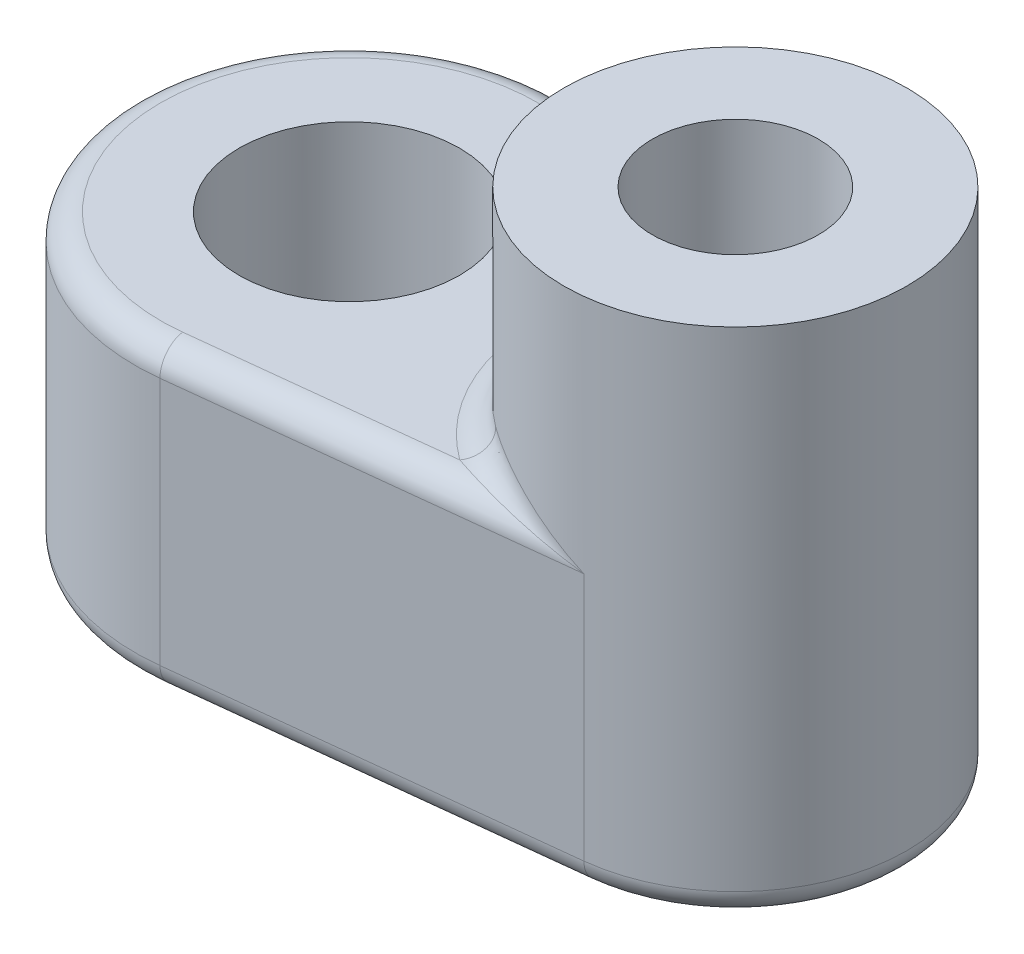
ISO-10303-21;
HEADER;
FILE_DESCRIPTION(('STEP AP214'),'2;1');
FILE_NAME('part.step','',(''),(''),'','','');
FILE_SCHEMA(('AUTOMOTIVE_DESIGN { 1 0 10303 214 1 1 1 1 }'));
ENDSEC;
DATA;
#1=APPLICATION_CONTEXT('core data for automotive mechanical design processes');
#2=APPLICATION_PROTOCOL_DEFINITION('international standard','automotive_design',2000,#1);
#3=PRODUCT_CONTEXT('',#1,'mechanical');
#4=PRODUCT('Part','Part','',(#3));
#5=PRODUCT_RELATED_PRODUCT_CATEGORY('part','',(#4));
#6=PRODUCT_DEFINITION_FORMATION('','',#4);
#7=PRODUCT_DEFINITION_CONTEXT('part definition',#1,'design');
#8=PRODUCT_DEFINITION('design','',#6,#7);
#9=PRODUCT_DEFINITION_SHAPE('','',#8);
#10=(LENGTH_UNIT() NAMED_UNIT(*) SI_UNIT(.MILLI.,.METRE.));
#11=(NAMED_UNIT(*) PLANE_ANGLE_UNIT() SI_UNIT($,.RADIAN.));
#12=(NAMED_UNIT(*) SI_UNIT($,.STERADIAN.) SOLID_ANGLE_UNIT());
#13=UNCERTAINTY_MEASURE_WITH_UNIT(LENGTH_MEASURE(1.E-05),#10,'distance_accuracy_value','');
#14=(GEOMETRIC_REPRESENTATION_CONTEXT(3) GLOBAL_UNCERTAINTY_ASSIGNED_CONTEXT((#13)) GLOBAL_UNIT_ASSIGNED_CONTEXT((#10,
#11,#12)) REPRESENTATION_CONTEXT('',''));
#15=CARTESIAN_POINT('',(0.,0.,0.));
#16=DIRECTION('',(0.,0.,1.));
#17=DIRECTION('',(1.,0.,0.));
#18=AXIS2_PLACEMENT_3D('',#15,#16,#17);
#19=CARTESIAN_POINT('',(-11.43,8.89,0.));
#20=DIRECTION('',(0.,-1.,0.));
#21=DIRECTION('',(0.,0.,-1.));
#22=AXIS2_PLACEMENT_3D('',#19,#20,#21);
#23=CYLINDRICAL_SURFACE('',#22,6.35);
#24=DIRECTION('',(0.,-1.,0.));
#25=VECTOR('',#24,1.);
#26=CARTESIAN_POINT('',(-10.7244444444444,8.89,-6.31068073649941));
#27=LINE('',#26,#25);
#28=CARTESIAN_POINT('',(-10.7244444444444,8.128,-6.31068073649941));
#29=VERTEX_POINT('',#28);
#30=CARTESIAN_POINT('',(-10.7244444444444,0.762000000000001,-6.31068073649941));
#31=VERTEX_POINT('',#30);
#32=EDGE_CURVE('E170',#29,#31,#27,.T.);
#33=ORIENTED_EDGE('',*,*,#32,.T.);
#34=CARTESIAN_POINT('',(-11.43,0.762000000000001,0.));
#35=DIRECTION('',(0.,1.,0.));
#36=DIRECTION('',(0.,0.,1.));
#37=AXIS2_PLACEMENT_3D('',#34,#35,#36);
#38=CIRCLE('',#37,6.35);
#39=CARTESIAN_POINT('',(-10.7244444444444,0.762000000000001,6.31068073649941));
#40=VERTEX_POINT('',#39);
#41=EDGE_CURVE('E139',#31,#40,#38,.T.);
#42=ORIENTED_EDGE('',*,*,#41,.T.);
#43=DIRECTION('',(0.,-1.,0.));
#44=VECTOR('',#43,1.);
#45=CARTESIAN_POINT('',(-10.7244444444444,8.89,6.31068073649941));
#46=LINE('',#45,#44);
#47=CARTESIAN_POINT('',(-10.7244444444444,8.128,6.31068073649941));
#48=VERTEX_POINT('',#47);
#49=EDGE_CURVE('E122',#48,#40,#46,.T.);
#50=ORIENTED_EDGE('',*,*,#49,.F.);
#51=CARTESIAN_POINT('',(-11.43,8.128,0.));
#52=DIRECTION('',(0.,1.,0.));
#53=DIRECTION('',(0.,0.,1.));
#54=AXIS2_PLACEMENT_3D('',#51,#52,#53);
#55=CIRCLE('',#54,6.35);
#56=EDGE_CURVE('E136',#48,#29,#55,.F.);
#57=ORIENTED_EDGE('',*,*,#56,.T.);
#58=EDGE_LOOP('',(#33,#42,#50,#57));
#59=FACE_BOUND('',#58,.T.);
#60=ADVANCED_FACE('F43',(#59),#23,.T.);
#61=CARTESIAN_POINT('',(-10.7244444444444,8.89,6.31068073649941));
#62=DIRECTION('',(-0.111111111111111,0.,-0.993807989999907));
#63=DIRECTION('',(-0.993807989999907,0.,0.111111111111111));
#64=AXIS2_PLACEMENT_3D('',#61,#62,#63);
#65=PLANE('',#64);
#66=ORIENTED_EDGE('',*,*,#49,.T.);
#67=DIRECTION('',(0.993807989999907,0.,-0.111111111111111));
#68=VECTOR('',#67,1.);
#69=CARTESIAN_POINT('',(-10.7244444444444,0.762000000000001,6.31068073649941));
#70=LINE('',#69,#68);
#71=CARTESIAN_POINT('',(0.564444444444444,0.762000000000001,5.04854458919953));
#72=VERTEX_POINT('',#71);
#73=EDGE_CURVE('E129',#40,#72,#70,.T.);
#74=ORIENTED_EDGE('',*,*,#73,.T.);
#75=DIRECTION('',(0.,-1.,0.));
#76=VECTOR('',#75,1.);
#77=CARTESIAN_POINT('',(0.564444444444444,8.89,5.04854458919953));
#78=LINE('',#77,#76);
#79=CARTESIAN_POINT('',(0.564444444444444,8.128,5.04854458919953));
#80=VERTEX_POINT('',#79);
#81=EDGE_CURVE('E124',#80,#72,#78,.T.);
#82=ORIENTED_EDGE('',*,*,#81,.F.);
#83=DIRECTION('',(0.993807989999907,0.,-0.111111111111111));
#84=VECTOR('',#83,1.);
#85=CARTESIAN_POINT('',(-10.7244444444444,8.128,6.31068073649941));
#86=LINE('',#85,#84);
#87=EDGE_CURVE('E119',#80,#48,#86,.F.);
#88=ORIENTED_EDGE('',*,*,#87,.T.);
#89=EDGE_LOOP('',(#66,#74,#82,#88));
#90=FACE_BOUND('',#89,.T.);
#91=ADVANCED_FACE('F121',(#90),#65,.F.);
#92=CARTESIAN_POINT('',(0.,8.89,0.));
#93=DIRECTION('',(0.,-1.,0.));
#94=DIRECTION('',(0.,0.,-1.));
#95=AXIS2_PLACEMENT_3D('',#92,#93,#94);
#96=CYLINDRICAL_SURFACE('',#95,5.08);
#97=ORIENTED_EDGE('',*,*,#81,.T.);
#98=CARTESIAN_POINT('',(0.,0.762000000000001,0.));
#99=DIRECTION('',(0.,1.,0.));
#100=DIRECTION('',(0.,0.,1.));
#101=AXIS2_PLACEMENT_3D('',#98,#99,#100);
#102=CIRCLE('',#101,5.08);
#103=CARTESIAN_POINT('',(0.564444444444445,0.762000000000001,-5.04854458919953));
#104=VERTEX_POINT('',#103);
#105=EDGE_CURVE('E181',#72,#104,#102,.T.);
#106=ORIENTED_EDGE('',*,*,#105,.T.);
#107=DIRECTION('',(0.,-1.,0.));
#108=VECTOR('',#107,1.);
#109=CARTESIAN_POINT('',(0.564444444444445,8.89,-5.04854458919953));
#110=LINE('',#109,#108);
#111=CARTESIAN_POINT('',(0.564444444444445,8.128,-5.04854458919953));
#112=VERTEX_POINT('',#111);
#113=EDGE_CURVE('E167',#112,#104,#110,.T.);
#114=ORIENTED_EDGE('',*,*,#113,.F.);
#115=CARTESIAN_POINT('',(-3.98769296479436,8.838619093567,-4.51395563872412));
#116=CARTESIAN_POINT('',(-3.29523797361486,8.62296157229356,-3.87593706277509));
#117=CARTESIAN_POINT('',(-3.49413608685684,9.549238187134,-3.68746701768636));
#118=CARTESIAN_POINT('',(-3.94517550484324,8.84782040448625,-4.53312874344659));
#119=CARTESIAN_POINT('',(-3.27762508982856,8.64982975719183,-3.88864594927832));
#120=CARTESIAN_POINT('',(-3.45486693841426,9.56764080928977,-3.72468824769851));
#121=CARTESIAN_POINT('',(-3.90141010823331,8.85564149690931,-4.55212354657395));
#122=CARTESIAN_POINT('',(-3.25763028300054,8.67632227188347,-3.90375735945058));
#123=CARTESIAN_POINT('',(-3.41451635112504,9.58328299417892,-3.76172112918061));
#124=CARTESIAN_POINT('',(-3.81176014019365,8.86873870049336,-4.58953542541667));
#125=CARTESIAN_POINT('',(-3.21327983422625,8.72697636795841,-3.93778229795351));
#126=CARTESIAN_POINT('',(-3.33200513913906,9.60947740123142,-3.83499183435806));
#127=CARTESIAN_POINT('',(-3.76587915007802,8.87401895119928,-4.60795339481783));
#128=CARTESIAN_POINT('',(-3.18904565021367,8.75117214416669,-3.95659184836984));
#129=CARTESIAN_POINT('',(-3.28984758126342,9.62003790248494,-3.87123085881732));
#130=CARTESIAN_POINT('',(-3.62631706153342,8.88632839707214,-4.66175561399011));
#131=CARTESIAN_POINT('',(-3.1113794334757,8.81805531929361,-4.01650319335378));
#132=CARTESIAN_POINT('',(-3.16182489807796,9.64465679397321,-3.97762311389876));
#133=CARTESIAN_POINT('',(-3.52988329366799,8.88999482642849,-4.69606578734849));
#134=CARTESIAN_POINT('',(-3.05151896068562,8.85739330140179,-4.06225554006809));
#135=CARTESIAN_POINT('',(-3.07363972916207,9.65198965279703,-4.04618422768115));
#136=CARTESIAN_POINT('',(-3.28429874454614,8.8900076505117,-4.77641232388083));
#137=CARTESIAN_POINT('',(-2.88753085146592,8.93578793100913,-4.18118395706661));
#138=CARTESIAN_POINT('',(-2.8497366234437,9.65201530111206,-4.20863583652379));
#139=CARTESIAN_POINT('',(-3.13201317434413,8.88200903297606,-4.82019827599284));
#140=CARTESIAN_POINT('',(-2.77486322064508,8.96849334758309,-4.25827629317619));
#141=CARTESIAN_POINT('',(-2.71147521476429,9.63601806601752,-4.29893773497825));
#142=CARTESIAN_POINT('',(-2.81961818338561,8.85449779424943,-4.89876490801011));
#143=CARTESIAN_POINT('',(-2.52900124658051,9.00345707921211,-4.40932739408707));
#144=CARTESIAN_POINT('',(-2.42892974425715,9.58099558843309,-4.46472811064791));
#145=CARTESIAN_POINT('',(-2.65946824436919,8.83491816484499,-4.933491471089));
#146=CARTESIAN_POINT('',(-2.3960602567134,9.00720488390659,-4.48385035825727));
#147=CARTESIAN_POINT('',(-2.28461521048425,9.54183632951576,-4.54012694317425));
#148=CARTESIAN_POINT('',(-2.37257788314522,8.79302674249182,-4.98675289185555));
#149=CARTESIAN_POINT('',(-2.14937275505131,8.99258864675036,-4.60626047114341));
#150=CARTESIAN_POINT('',(-2.02695128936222,9.45805348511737,-4.65973095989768));
#151=CARTESIAN_POINT('',(-2.24672128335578,8.77240697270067,-5.00717512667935));
#152=CARTESIAN_POINT('',(-2.03913010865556,8.97973066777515,-4.65630858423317));
#153=CARTESIAN_POINT('',(-1.91419870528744,9.41681394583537,-4.70711341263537));
#154=CARTESIAN_POINT('',(-1.99319148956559,8.72739593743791,-5.0427978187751));
#155=CARTESIAN_POINT('',(-1.81398250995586,8.94298299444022,-4.74845264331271));
#156=CARTESIAN_POINT('',(-1.68759578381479,9.32679187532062,-4.79302745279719));
#157=CARTESIAN_POINT('',(-1.86551763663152,8.70300327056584,-5.05799632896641));
#158=CARTESIAN_POINT('',(-1.69877073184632,8.91932611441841,-4.7909457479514));
#159=CARTESIAN_POINT('',(-1.5737450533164,9.27800654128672,-4.83155573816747));
#160=CARTESIAN_POINT('',(-1.48068217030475,8.6255108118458,-5.09604592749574));
#161=CARTESIAN_POINT('',(-1.35275670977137,8.8363972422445,-4.90384090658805));
#162=CARTESIAN_POINT('',(-1.23132063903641,9.12302162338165,-4.93427241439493));
#163=CARTESIAN_POINT('',(-1.22160366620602,8.5680801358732,-5.11136969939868));
#164=CARTESIAN_POINT('',(-1.11105665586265,8.76369080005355,-4.96438587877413));
#165=CARTESIAN_POINT('',(-1.00178228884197,9.00816027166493,-4.98563468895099));
#166=CARTESIAN_POINT('',(-0.709926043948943,8.44868944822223,-5.12315099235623));
#167=CARTESIAN_POINT('',(-0.633840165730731,8.60191773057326,-5.0464401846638));
#168=CARTESIAN_POINT('',(-0.550220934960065,8.7693788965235,-5.05512875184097));
#169=CARTESIAN_POINT('',(-0.457368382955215,8.38691933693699,-5.12016594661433));
#170=CARTESIAN_POINT('',(-0.395248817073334,8.512855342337,-5.07063154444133));
#171=CARTESIAN_POINT('',(-0.328180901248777,8.64583867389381,-5.07422002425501));
#172=CARTESIAN_POINT('',(0.0474791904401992,8.26057595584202,-5.09750209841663));
#173=CARTESIAN_POINT('',(0.0785190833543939,8.32748328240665,-5.08491889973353));
#174=CARTESIAN_POINT('',(0.114060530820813,8.39315191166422,-5.08352345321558));
#175=CARTESIAN_POINT('',(0.299769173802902,8.19600418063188,-5.07783209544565));
#176=CARTESIAN_POINT('',(0.316966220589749,8.23001714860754,-5.07560153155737));
#177=CARTESIAN_POINT('',(0.334262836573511,8.26400836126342,-5.07375082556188));
#178=CARTESIAN_POINT('',(0.555424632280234,8.13031772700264,-5.04955037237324));
#179=CARTESIAN_POINT('',(0.556012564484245,8.1314765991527,-5.0494820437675));
#180=CARTESIAN_POINT('',(0.556600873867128,8.13263545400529,-5.04941689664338));
#181=CARTESIAN_POINT('',(0.559934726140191,8.1291588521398,-5.04904878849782));
#182=CARTESIAN_POINT('',(0.560228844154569,8.12973828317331,-5.04901597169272));
#183=CARTESIAN_POINT('',(0.560522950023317,8.13031770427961,-5.04898302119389));
#184=CARTESIAN_POINT('',(0.564444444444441,8.128,-5.04854458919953));
#185=CARTESIAN_POINT('',(0.564444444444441,8.128,-5.04854458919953));
#186=CARTESIAN_POINT('',(0.564444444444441,8.128,-5.04854458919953));
#187=(BOUNDED_SURFACE() B_SPLINE_SURFACE(3,2,((#115,#116,#117),(#118,#119,#120),(#121,#122,
#123),(#124,#125,#126),(#127,#128,#129),(#130,#131,#132),(#133,#134,#135),(#136,#137,#138),
(#139,#140,#141),(#142,#143,#144),(#145,#146,#147),(#148,#149,#150),(#151,#152,#153),(#154,#155,
#156),(#157,#158,#159),(#160,#161,#162),(#163,#164,#165),(#166,#167,#168),(#169,#170,#171),
(#172,#173,#174),(#175,#176,#177),(#178,#179,#180),(#181,#182,#183),(#184,#185,#186)),
.UNSPECIFIED.,.F.,.F.,.F.) B_SPLINE_SURFACE_WITH_KNOTS((4,2,2,2,2,2,2,2,2,2,2,4),(3,3),(0.,
0.19449394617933,0.388669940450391,0.773264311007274,1.34199013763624,1.91403927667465,
2.3531646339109,2.79245349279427,3.67067146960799,4.52228656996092,5.37345281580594,
5.38873941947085),(0.,1.),
.UNSPECIFIED.) GEOMETRIC_REPRESENTATION_ITEM() RATIONAL_B_SPLINE_SURFACE(((1.,0.619345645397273,
1.),(1.,0.626282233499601,1.),(1.,0.633401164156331,1.),(1.,0.647874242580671,1.),(1.,
0.655227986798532,1.),(1.,0.677339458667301,1.),(1.,0.692286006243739,1.),(1.,0.729023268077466,
1.),(1.,0.750664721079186,1.),(1.,0.792058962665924,1.),(1.,0.811799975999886,1.),(1.,
0.844317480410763,1.),(1.,0.857646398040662,1.),(1.,0.882590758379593,1.),(1.,0.89420556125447,
1.),(1.,0.926359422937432,1.),(1.,0.944219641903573,1.),(1.,0.972190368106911,1.),(1.,
0.982519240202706,1.),(1.,0.996359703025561,1.),(1.,0.999874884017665,1.),(1.,0.999998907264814,
1.),(1.,1.00000000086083,1.),(1.,1.,1.))) REPRESENTATION_ITEM('') SURFACE());
#188=CARTESIAN_POINT('',(-3.49413608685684,9.549238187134,-3.68746701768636));
#189=CARTESIAN_POINT('',(-3.45486693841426,9.56764080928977,-3.72468824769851));
#190=CARTESIAN_POINT('',(-3.41451635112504,9.58328299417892,-3.76172112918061));
#191=CARTESIAN_POINT('',(-3.33200513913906,9.60947740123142,-3.83499183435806));
#192=CARTESIAN_POINT('',(-3.28984758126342,9.62003790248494,-3.87123085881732));
#193=CARTESIAN_POINT('',(-3.16182489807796,9.64465679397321,-3.97762311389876));
#194=CARTESIAN_POINT('',(-3.07363972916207,9.65198965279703,-4.04618422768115));
#195=CARTESIAN_POINT('',(-2.8497366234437,9.65201530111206,-4.20863583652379));
#196=CARTESIAN_POINT('',(-2.71147521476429,9.63601806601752,-4.29893773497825));
#197=CARTESIAN_POINT('',(-2.42892974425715,9.58099558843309,-4.46472811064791));
#198=CARTESIAN_POINT('',(-2.28461521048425,9.54183632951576,-4.54012694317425));
#199=CARTESIAN_POINT('',(-2.02695128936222,9.45805348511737,-4.65973095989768));
#200=CARTESIAN_POINT('',(-1.91419870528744,9.41681394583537,-4.70711341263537));
#201=CARTESIAN_POINT('',(-1.68759578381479,9.32679187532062,-4.79302745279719));
#202=CARTESIAN_POINT('',(-1.5737450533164,9.27800654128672,-4.83155573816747));
#203=CARTESIAN_POINT('',(-1.23132063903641,9.12302162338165,-4.93427241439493));
#204=CARTESIAN_POINT('',(-1.00178228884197,9.00816027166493,-4.98563468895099));
#205=CARTESIAN_POINT('',(-0.550220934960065,8.7693788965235,-5.05512875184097));
#206=CARTESIAN_POINT('',(-0.32818090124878,8.64583867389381,-5.07422002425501));
#207=CARTESIAN_POINT('',(0.114060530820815,8.39315191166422,-5.08352345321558));
#208=CARTESIAN_POINT('',(0.334262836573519,8.26400836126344,-5.07375082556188));
#209=CARTESIAN_POINT('',(0.556600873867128,8.13263545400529,-5.04941689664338));
#210=CARTESIAN_POINT('',(0.560522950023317,8.13031770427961,-5.04898302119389));
#211=CARTESIAN_POINT('',(0.564444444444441,8.128,-5.04854458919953));
#212=B_SPLINE_CURVE_WITH_KNOTS('',3,(#188,#189,#190,#191,#192,#193,#194,#195,#196,#197,#198,
#199,#200,#201,#202,#203,#204,#205,#206,#207,#208,#209,#210,#211),.UNSPECIFIED.,.F.,.F.,(4,2,2,
2,2,2,2,2,2,2,2,4),(0.,0.19449394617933,0.388669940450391,0.773264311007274,1.34199013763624,
1.91403927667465,2.3531646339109,2.79245349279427,3.67067146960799,4.52228656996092,
5.37345281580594,5.38873941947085),.UNSPECIFIED.);
#213=CARTESIAN_POINT('',(-2.98331134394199,9.652,-4.11172146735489));
#214=VERTEX_POINT('',#213);
#215=EDGE_CURVE('E52',#112,#214,#212,.F.);
#216=ORIENTED_EDGE('',*,*,#215,.T.);
#217=CARTESIAN_POINT('',(0.,9.652,0.));
#218=DIRECTION('',(0.,1.,0.));
#219=DIRECTION('',(0.,0.,1.));
#220=AXIS2_PLACEMENT_3D('',#217,#218,#219);
#221=CIRCLE('',#220,5.08);
#222=CARTESIAN_POINT('',(-2.98331134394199,9.652,4.11172146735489));
#223=VERTEX_POINT('',#222);
#224=EDGE_CURVE('E179',#214,#223,#221,.T.);
#225=ORIENTED_EDGE('',*,*,#224,.T.);
#226=CARTESIAN_POINT('',(-3.49413608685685,9.549238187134,3.68746701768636));
#227=CARTESIAN_POINT('',(-3.29523797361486,8.62296157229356,3.87593706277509));
#228=CARTESIAN_POINT('',(-3.98769296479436,8.838619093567,4.51395563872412));
#229=CARTESIAN_POINT('',(-3.45486693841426,9.56764080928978,3.72468824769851));
#230=CARTESIAN_POINT('',(-3.27762508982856,8.64982975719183,3.88864594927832));
#231=CARTESIAN_POINT('',(-3.94517550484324,8.84782040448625,4.5331287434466));
#232=CARTESIAN_POINT('',(-3.41451635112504,9.58328299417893,3.76172112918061));
#233=CARTESIAN_POINT('',(-3.25763028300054,8.67632227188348,3.90375735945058));
#234=CARTESIAN_POINT('',(-3.9014101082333,8.85564149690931,4.55212354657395));
#235=CARTESIAN_POINT('',(-3.33200513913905,9.60947740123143,3.83499183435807));
#236=CARTESIAN_POINT('',(-3.21327983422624,8.72697636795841,3.93778229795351));
#237=CARTESIAN_POINT('',(-3.81176014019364,8.86873870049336,4.58953542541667));
#238=CARTESIAN_POINT('',(-3.28984758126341,9.62003790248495,3.87123085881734));
#239=CARTESIAN_POINT('',(-3.18904565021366,8.75117214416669,3.95659184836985));
#240=CARTESIAN_POINT('',(-3.76587915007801,8.87401895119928,4.60795339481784));
#241=CARTESIAN_POINT('',(-3.16182489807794,9.64465679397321,3.97762311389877));
#242=CARTESIAN_POINT('',(-3.11137943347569,8.81805531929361,4.01650319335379));
#243=CARTESIAN_POINT('',(-3.62631706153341,8.88632839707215,4.66175561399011));
#244=CARTESIAN_POINT('',(-3.07363972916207,9.65198965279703,4.04618422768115));
#245=CARTESIAN_POINT('',(-3.05151896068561,8.85739330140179,4.06225554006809));
#246=CARTESIAN_POINT('',(-3.52988329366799,8.88999482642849,4.69606578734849));
#247=CARTESIAN_POINT('',(-2.84973662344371,9.65201530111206,4.20863583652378));
#248=CARTESIAN_POINT('',(-2.88753085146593,8.93578793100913,4.18118395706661));
#249=CARTESIAN_POINT('',(-3.28429874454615,8.8900076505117,4.77641232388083));
#250=CARTESIAN_POINT('',(-2.71147521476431,9.63601806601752,4.29893773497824));
#251=CARTESIAN_POINT('',(-2.77486322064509,8.96849334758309,4.25827629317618));
#252=CARTESIAN_POINT('',(-3.13201317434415,8.88200903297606,4.82019827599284));
#253=CARTESIAN_POINT('',(-2.42892974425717,9.58099558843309,4.4647281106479));
#254=CARTESIAN_POINT('',(-2.52900124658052,9.00345707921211,4.40932739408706));
#255=CARTESIAN_POINT('',(-2.81961818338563,8.85449779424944,4.8987649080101));
#256=CARTESIAN_POINT('',(-2.28461521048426,9.54183632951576,4.54012694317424));
#257=CARTESIAN_POINT('',(-2.39606025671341,9.00720488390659,4.48385035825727));
#258=CARTESIAN_POINT('',(-2.6594682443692,8.83491816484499,4.933491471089));
#259=CARTESIAN_POINT('',(-2.02695128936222,9.45805348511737,4.65973095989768));
#260=CARTESIAN_POINT('',(-2.14937275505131,8.99258864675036,4.60626047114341));
#261=CARTESIAN_POINT('',(-2.37257788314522,8.79302674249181,4.98675289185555));
#262=CARTESIAN_POINT('',(-1.91419870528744,9.41681394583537,4.70711341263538));
#263=CARTESIAN_POINT('',(-2.03913010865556,8.97973066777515,4.65630858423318));
#264=CARTESIAN_POINT('',(-2.24672128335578,8.77240697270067,5.00717512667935));
#265=CARTESIAN_POINT('',(-1.68759578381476,9.32679187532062,4.7930274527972));
#266=CARTESIAN_POINT('',(-1.81398250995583,8.94298299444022,4.74845264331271));
#267=CARTESIAN_POINT('',(-1.99319148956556,8.72739593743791,5.0427978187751));
#268=CARTESIAN_POINT('',(-1.57374505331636,9.27800654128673,4.83155573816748));
#269=CARTESIAN_POINT('',(-1.69877073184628,8.91932611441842,4.79094574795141));
#270=CARTESIAN_POINT('',(-1.86551763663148,8.70300327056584,5.05799632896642));
#271=CARTESIAN_POINT('',(-1.2313206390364,9.1230216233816,4.93427241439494));
#272=CARTESIAN_POINT('',(-1.35275670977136,8.83639724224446,4.90384090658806));
#273=CARTESIAN_POINT('',(-1.48068217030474,8.62551081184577,5.09604592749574));
#274=CARTESIAN_POINT('',(-1.00178228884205,9.00816027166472,4.985634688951));
#275=CARTESIAN_POINT('',(-1.11105665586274,8.76369080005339,4.96438587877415));
#276=CARTESIAN_POINT('',(-1.22160366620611,8.5680801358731,5.11136969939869));
#277=CARTESIAN_POINT('',(-0.550220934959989,8.76937889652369,5.05512875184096));
#278=CARTESIAN_POINT('',(-0.633840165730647,8.60191773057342,5.04644018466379));
#279=CARTESIAN_POINT('',(-0.709926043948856,8.44868944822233,5.12315099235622));
#280=CARTESIAN_POINT('',(-0.328180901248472,8.64583867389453,5.07422002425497));
#281=CARTESIAN_POINT('',(-0.395248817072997,8.51285534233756,5.07063154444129));
#282=CARTESIAN_POINT('',(-0.457368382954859,8.38691933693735,5.12016594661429));
#283=CARTESIAN_POINT('',(0.11406053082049,8.39315191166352,5.08352345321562));
#284=CARTESIAN_POINT('',(0.0785190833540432,8.32748328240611,5.08491889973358));
#285=CARTESIAN_POINT('',(0.0474791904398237,8.26057595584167,5.09750209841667));
#286=CARTESIAN_POINT('',(0.334262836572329,8.26400836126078,5.073750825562));
#287=CARTESIAN_POINT('',(0.31696622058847,8.23001714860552,5.07560153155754));
#288=CARTESIAN_POINT('',(0.299769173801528,8.19600418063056,5.07783209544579));
#289=CARTESIAN_POINT('',(0.556600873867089,8.13263545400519,5.04941689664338));
#290=CARTESIAN_POINT('',(0.556012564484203,8.13147659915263,5.04948204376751));
#291=CARTESIAN_POINT('',(0.555424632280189,8.13031772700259,5.04955037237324));
#292=CARTESIAN_POINT('',(0.560522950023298,8.13031770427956,5.0489830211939));
#293=CARTESIAN_POINT('',(0.560228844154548,8.12973828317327,5.04901597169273));
#294=CARTESIAN_POINT('',(0.559934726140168,8.12915885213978,5.04904878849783));
#295=CARTESIAN_POINT('',(0.564444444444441,8.128,5.04854458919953));
#296=CARTESIAN_POINT('',(0.564444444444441,8.128,5.04854458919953));
#297=CARTESIAN_POINT('',(0.564444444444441,8.128,5.04854458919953));
#298=(BOUNDED_SURFACE() B_SPLINE_SURFACE(3,2,((#226,#227,#228),(#229,#230,#231),(#232,#233,
#234),(#235,#236,#237),(#238,#239,#240),(#241,#242,#243),(#244,#245,#246),(#247,#248,#249),
(#250,#251,#252),(#253,#254,#255),(#256,#257,#258),(#259,#260,#261),(#262,#263,#264),(#265,#266,
#267),(#268,#269,#270),(#271,#272,#273),(#274,#275,#276),(#277,#278,#279),(#280,#281,#282),
(#283,#284,#285),(#286,#287,#288),(#289,#290,#291),(#292,#293,#294),(#295,#296,#297)),
.UNSPECIFIED.,.F.,.F.,.F.) B_SPLINE_SURFACE_WITH_KNOTS((4,2,2,2,2,2,2,2,2,2,2,4),(3,3),(0.,
0.194493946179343,0.38866994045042,0.773264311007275,1.34199013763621,1.91403927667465,
2.35316463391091,2.79245349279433,3.67067146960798,4.52228656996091,5.37345281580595,
5.38873941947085),(0.,1.),
.UNSPECIFIED.) GEOMETRIC_REPRESENTATION_ITEM() RATIONAL_B_SPLINE_SURFACE(((1.,0.619345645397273,
1.),(1.,0.626282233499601,1.),(1.,0.633401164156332,1.),(1.,0.647874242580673,1.),(1.,
0.655227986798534,1.),(1.,0.677339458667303,1.),(1.,0.69228600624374,1.),(1.,0.729023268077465,
1.),(1.,0.750664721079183,1.),(1.,0.792058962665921,1.),(1.,0.811799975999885,1.),(1.,
0.844317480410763,1.),(1.,0.857646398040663,1.),(1.,0.882590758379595,1.),(1.,0.894205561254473,
1.),(1.,0.926359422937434,1.),(1.,0.944219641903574,1.),(1.,0.97219036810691,1.),(1.,
0.982519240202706,1.),(1.,0.996359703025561,1.),(1.,0.999874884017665,1.),(1.,0.999998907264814,
1.),(1.,1.00000000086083,1.),(1.,1.,1.))) REPRESENTATION_ITEM('') SURFACE());
#299=CARTESIAN_POINT('',(-3.49413608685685,9.549238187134,3.68746701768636));
#300=CARTESIAN_POINT('',(-3.45486693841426,9.56764080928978,3.72468824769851));
#301=CARTESIAN_POINT('',(-3.41451635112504,9.58328299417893,3.76172112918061));
#302=CARTESIAN_POINT('',(-3.33200513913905,9.60947740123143,3.83499183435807));
#303=CARTESIAN_POINT('',(-3.28984758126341,9.62003790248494,3.87123085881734));
#304=CARTESIAN_POINT('',(-3.16182489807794,9.64465679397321,3.97762311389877));
#305=CARTESIAN_POINT('',(-3.07363972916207,9.65198965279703,4.04618422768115));
#306=CARTESIAN_POINT('',(-2.84973662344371,9.65201530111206,4.20863583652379));
#307=CARTESIAN_POINT('',(-2.71147521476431,9.63601806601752,4.29893773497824));
#308=CARTESIAN_POINT('',(-2.42892974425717,9.58099558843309,4.4647281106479));
#309=CARTESIAN_POINT('',(-2.28461521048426,9.54183632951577,4.54012694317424));
#310=CARTESIAN_POINT('',(-2.02695128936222,9.45805348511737,4.65973095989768));
#311=CARTESIAN_POINT('',(-1.91419870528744,9.41681394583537,4.70711341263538));
#312=CARTESIAN_POINT('',(-1.68759578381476,9.32679187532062,4.7930274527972));
#313=CARTESIAN_POINT('',(-1.57374505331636,9.27800654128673,4.83155573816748));
#314=CARTESIAN_POINT('',(-1.2313206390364,9.1230216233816,4.93427241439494));
#315=CARTESIAN_POINT('',(-1.00178228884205,9.00816027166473,4.985634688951));
#316=CARTESIAN_POINT('',(-0.550220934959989,8.76937889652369,5.05512875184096));
#317=CARTESIAN_POINT('',(-0.328180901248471,8.64583867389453,5.07422002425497));
#318=CARTESIAN_POINT('',(0.114060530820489,8.39315191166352,5.08352345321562));
#319=CARTESIAN_POINT('',(0.334262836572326,8.2640083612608,5.073750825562));
#320=CARTESIAN_POINT('',(0.556600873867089,8.13263545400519,5.04941689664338));
#321=CARTESIAN_POINT('',(0.560522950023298,8.13031770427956,5.0489830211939));
#322=CARTESIAN_POINT('',(0.564444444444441,8.128,5.04854458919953));
#323=B_SPLINE_CURVE_WITH_KNOTS('',3,(#299,#300,#301,#302,#303,#304,#305,#306,#307,#308,#309,
#310,#311,#312,#313,#314,#315,#316,#317,#318,#319,#320,#321,#322),.UNSPECIFIED.,.F.,.F.,(4,2,2,
2,2,2,2,2,2,2,2,4),(0.,0.194493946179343,0.38866994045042,0.773264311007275,1.34199013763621,
1.91403927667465,2.35316463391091,2.79245349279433,3.67067146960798,4.52228656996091,
5.37345281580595,5.38873941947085),.UNSPECIFIED.);
#324=EDGE_CURVE('E11',#223,#80,#323,.T.);
#325=ORIENTED_EDGE('',*,*,#324,.T.);
#326=EDGE_LOOP('',(#97,#106,#114,#216,#225,#325));
#327=FACE_BOUND('',#326,.T.);
#328=CARTESIAN_POINT('',(0.,15.24,0.));
#329=DIRECTION('',(0.,1.,0.));
#330=DIRECTION('',(0.,0.,1.));
#331=AXIS2_PLACEMENT_3D('',#328,#329,#330);
#332=CIRCLE('',#331,5.08);
#333=CARTESIAN_POINT('',(0.,15.24,5.08));
#334=VERTEX_POINT('',#333);
#335=EDGE_CURVE('E458',#334,#334,#332,.T.);
#336=ORIENTED_EDGE('',*,*,#335,.F.);
#337=EDGE_LOOP('',(#336));
#338=FACE_BOUND('',#337,.T.);
#339=ADVANCED_FACE('F202',(#327,#338),#96,.T.);
#340=CARTESIAN_POINT('',(-10.7244444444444,8.89,-6.31068073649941));
#341=DIRECTION('',(-0.111111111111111,0.,0.993807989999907));
#342=DIRECTION('',(0.993807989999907,0.,0.111111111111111));
#343=AXIS2_PLACEMENT_3D('',#340,#341,#342);
#344=PLANE('',#343);
#345=ORIENTED_EDGE('',*,*,#113,.T.);
#346=DIRECTION('',(-0.993807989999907,0.,-0.111111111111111));
#347=VECTOR('',#346,1.);
#348=CARTESIAN_POINT('',(-10.7244444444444,0.762000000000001,-6.31068073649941));
#349=LINE('',#348,#347);
#350=EDGE_CURVE('E178',#104,#31,#349,.T.);
#351=ORIENTED_EDGE('',*,*,#350,.T.);
#352=ORIENTED_EDGE('',*,*,#32,.F.);
#353=DIRECTION('',(-0.993807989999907,0.,-0.111111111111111));
#354=VECTOR('',#353,1.);
#355=CARTESIAN_POINT('',(0.564444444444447,8.128,-5.04854458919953));
#356=LINE('',#355,#354);
#357=EDGE_CURVE('E166',#29,#112,#356,.F.);
#358=ORIENTED_EDGE('',*,*,#357,.T.);
#359=EDGE_LOOP('',(#345,#351,#352,#358));
#360=FACE_BOUND('',#359,.T.);
#361=ADVANCED_FACE('F207',(#360),#344,.F.);
#362=CARTESIAN_POINT('',(-11.43,8.89,0.));
#363=DIRECTION('',(0.,1.,0.));
#364=DIRECTION('',(0.,0.,1.));
#365=AXIS2_PLACEMENT_3D('',#362,#363,#364);
#366=PLANE('',#365);
#367=CARTESIAN_POINT('',(0.,8.89,0.));
#368=DIRECTION('',(0.,1.,0.));
#369=DIRECTION('',(0.,0.,1.));
#370=AXIS2_PLACEMENT_3D('',#367,#368,#369);
#371=CIRCLE('',#370,5.842);
#372=CARTESIAN_POINT('',(-3.43080804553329,8.89,4.72847968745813));
#373=VERTEX_POINT('',#372);
#374=CARTESIAN_POINT('',(-3.43080804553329,8.89,-4.72847968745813));
#375=VERTEX_POINT('',#374);
#376=EDGE_CURVE('E68',#373,#375,#371,.F.);
#377=ORIENTED_EDGE('',*,*,#376,.T.);
#378=DIRECTION('',(-0.993807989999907,0.,-0.111111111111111));
#379=VECTOR('',#378,1.);
#380=CARTESIAN_POINT('',(-10.8091111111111,8.89,-5.55339904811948));
#381=LINE('',#380,#379);
#382=CARTESIAN_POINT('',(-10.8091111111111,8.89,-5.55339904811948));
#383=VERTEX_POINT('',#382);
#384=EDGE_CURVE('E130',#375,#383,#381,.T.);
#385=ORIENTED_EDGE('',*,*,#384,.T.);
#386=CARTESIAN_POINT('',(-11.43,8.89,0.));
#387=DIRECTION('',(0.,1.,0.));
#388=DIRECTION('',(0.,0.,1.));
#389=AXIS2_PLACEMENT_3D('',#386,#387,#388);
#390=CIRCLE('',#389,5.588);
#391=CARTESIAN_POINT('',(-10.8091111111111,8.89,5.55339904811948));
#392=VERTEX_POINT('',#391);
#393=EDGE_CURVE('E185',#383,#392,#390,.T.);
#394=ORIENTED_EDGE('',*,*,#393,.T.);
#395=DIRECTION('',(0.993807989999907,0.,-0.111111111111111));
#396=VECTOR('',#395,1.);
#397=CARTESIAN_POINT('',(0.47977777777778,8.89,4.2912629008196));
#398=LINE('',#397,#396);
#399=EDGE_CURVE('E145',#392,#373,#398,.T.);
#400=ORIENTED_EDGE('',*,*,#399,.T.);
#401=EDGE_LOOP('',(#377,#385,#394,#400));
#402=FACE_BOUND('',#401,.T.);
#403=CARTESIAN_POINT('',(-11.43,8.89,0.));
#404=DIRECTION('',(0.,1.,0.));
#405=DIRECTION('',(0.,0.,1.));
#406=AXIS2_PLACEMENT_3D('',#403,#404,#405);
#407=CIRCLE('',#406,3.2639);
#408=CARTESIAN_POINT('',(-11.43,8.89,3.2639));
#409=VERTEX_POINT('',#408);
#410=EDGE_CURVE('E155',#409,#409,#407,.T.);
#411=ORIENTED_EDGE('',*,*,#410,.F.);
#412=EDGE_LOOP('',(#411));
#413=FACE_BOUND('',#412,.T.);
#414=ADVANCED_FACE('F280',(#402,#413),#366,.T.);
#415=CARTESIAN_POINT('',(-11.43,0.,0.));
#416=DIRECTION('',(0.,1.,0.));
#417=DIRECTION('',(0.,0.,1.));
#418=AXIS2_PLACEMENT_3D('',#415,#416,#417);
#419=PLANE('',#418);
#420=DIRECTION('',(0.993807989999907,0.,-0.111111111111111));
#421=VECTOR('',#420,1.);
#422=CARTESIAN_POINT('',(-10.8091111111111,0.,5.55339904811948));
#423=LINE('',#422,#421);
#424=CARTESIAN_POINT('',(0.479777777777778,0.,4.2912629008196));
#425=VERTEX_POINT('',#424);
#426=CARTESIAN_POINT('',(-10.8091111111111,0.,5.55339904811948));
#427=VERTEX_POINT('',#426);
#428=EDGE_CURVE('E152',#425,#427,#423,.F.);
#429=ORIENTED_EDGE('',*,*,#428,.T.);
#430=CARTESIAN_POINT('',(-11.43,0.,0.));
#431=DIRECTION('',(0.,1.,0.));
#432=DIRECTION('',(0.,0.,1.));
#433=AXIS2_PLACEMENT_3D('',#430,#431,#432);
#434=CIRCLE('',#433,5.588);
#435=CARTESIAN_POINT('',(-10.8091111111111,0.,-5.55339904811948));
#436=VERTEX_POINT('',#435);
#437=EDGE_CURVE('E163',#427,#436,#434,.F.);
#438=ORIENTED_EDGE('',*,*,#437,.T.);
#439=DIRECTION('',(-0.993807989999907,0.,-0.111111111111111));
#440=VECTOR('',#439,1.);
#441=CARTESIAN_POINT('',(-10.8091111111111,0.,-5.55339904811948));
#442=LINE('',#441,#440);
#443=CARTESIAN_POINT('',(0.479777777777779,0.,-4.2912629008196));
#444=VERTEX_POINT('',#443);
#445=EDGE_CURVE('E161',#436,#444,#442,.F.);
#446=ORIENTED_EDGE('',*,*,#445,.T.);
#447=CARTESIAN_POINT('',(0.,0.,0.));
#448=DIRECTION('',(0.,1.,0.));
#449=DIRECTION('',(0.,0.,1.));
#450=AXIS2_PLACEMENT_3D('',#447,#448,#449);
#451=CIRCLE('',#450,4.318);
#452=EDGE_CURVE('E159',#444,#425,#451,.F.);
#453=ORIENTED_EDGE('',*,*,#452,.T.);
#454=EDGE_LOOP('',(#429,#438,#446,#453));
#455=FACE_BOUND('',#454,.T.);
#456=CARTESIAN_POINT('',(-11.43,0.,0.));
#457=DIRECTION('',(0.,-1.,0.));
#458=DIRECTION('',(0.,0.,-1.));
#459=AXIS2_PLACEMENT_3D('',#456,#457,#458);
#460=CIRCLE('',#459,3.2639);
#461=CARTESIAN_POINT('',(-11.43,0.,-3.2639));
#462=VERTEX_POINT('',#461);
#463=EDGE_CURVE('E443',#462,#462,#460,.T.);
#464=ORIENTED_EDGE('',*,*,#463,.F.);
#465=EDGE_LOOP('',(#464));
#466=FACE_BOUND('',#465,.T.);
#467=CARTESIAN_POINT('',(0.,0.,0.));
#468=DIRECTION('',(0.,-1.,0.));
#469=DIRECTION('',(0.,0.,-1.));
#470=AXIS2_PLACEMENT_3D('',#467,#468,#469);
#471=CIRCLE('',#470,2.45744999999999);
#472=CARTESIAN_POINT('',(0.,0.,-2.45744999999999));
#473=VERTEX_POINT('',#472);
#474=EDGE_CURVE('E465',#473,#473,#471,.T.);
#475=ORIENTED_EDGE('',*,*,#474,.F.);
#476=EDGE_LOOP('',(#475));
#477=FACE_BOUND('',#476,.T.);
#478=ADVANCED_FACE('F287',(#455,#466,#477),#419,.F.);
#479=CARTESIAN_POINT('',(0.,15.24,0.));
#480=DIRECTION('',(0.,1.,0.));
#481=DIRECTION('',(0.,0.,1.));
#482=AXIS2_PLACEMENT_3D('',#479,#480,#481);
#483=PLANE('',#482);
#484=CARTESIAN_POINT('',(0.,15.24,0.));
#485=DIRECTION('',(0.,-1.,0.));
#486=DIRECTION('',(0.,0.,-1.));
#487=AXIS2_PLACEMENT_3D('',#484,#485,#486);
#488=CIRCLE('',#487,2.45745);
#489=CARTESIAN_POINT('',(0.,15.24,-2.45745));
#490=VERTEX_POINT('',#489);
#491=EDGE_CURVE('E460',#490,#490,#488,.T.);
#492=ORIENTED_EDGE('',*,*,#491,.T.);
#493=EDGE_LOOP('',(#492));
#494=FACE_BOUND('',#493,.T.);
#495=ORIENTED_EDGE('',*,*,#335,.T.);
#496=EDGE_LOOP('',(#495));
#497=FACE_BOUND('',#496,.T.);
#498=ADVANCED_FACE('F294',(#494,#497),#483,.T.);
#499=CARTESIAN_POINT('',(0.,0.,0.));
#500=DIRECTION('',(0.,-1.,0.));
#501=DIRECTION('',(0.,0.,-1.));
#502=AXIS2_PLACEMENT_3D('',#499,#500,#501);
#503=CYLINDRICAL_SURFACE('',#502,2.45744999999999);
#504=ORIENTED_EDGE('',*,*,#491,.F.);
#505=EDGE_LOOP('',(#504));
#506=FACE_BOUND('',#505,.T.);
#507=ORIENTED_EDGE('',*,*,#474,.T.);
#508=EDGE_LOOP('',(#507));
#509=FACE_BOUND('',#508,.T.);
#510=ADVANCED_FACE('F302',(#506,#509),#503,.F.);
#511=CARTESIAN_POINT('',(-11.43,0.,0.));
#512=DIRECTION('',(0.,-1.,0.));
#513=DIRECTION('',(0.,0.,-1.));
#514=AXIS2_PLACEMENT_3D('',#511,#512,#513);
#515=CYLINDRICAL_SURFACE('',#514,3.2639);
#516=ORIENTED_EDGE('',*,*,#410,.T.);
#517=EDGE_LOOP('',(#516));
#518=FACE_BOUND('',#517,.T.);
#519=ORIENTED_EDGE('',*,*,#463,.T.);
#520=EDGE_LOOP('',(#519));
#521=FACE_BOUND('',#520,.T.);
#522=ADVANCED_FACE('F310',(#518,#521),#515,.F.);
#523=CARTESIAN_POINT('',(0.,0.762000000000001,0.));
#524=DIRECTION('',(0.,1.,0.));
#525=DIRECTION('',(0.,0.,1.));
#526=AXIS2_PLACEMENT_3D('',#523,#524,#525);
#527=TOROIDAL_SURFACE('',#526,4.318,0.762);
#528=CARTESIAN_POINT('',(0.479777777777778,0.762,4.2912629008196));
#529=DIRECTION('',(-0.993807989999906,0.,0.111111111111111));
#530=DIRECTION('',(0.111111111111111,0.,0.993807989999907));
#531=AXIS2_PLACEMENT_3D('',#528,#529,#530);
#532=CIRCLE('',#531,0.762);
#533=EDGE_CURVE('E436',#425,#72,#532,.T.);
#534=ORIENTED_EDGE('',*,*,#533,.F.);
#535=ORIENTED_EDGE('',*,*,#452,.F.);
#536=CARTESIAN_POINT('',(0.479777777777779,0.762000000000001,-4.2912629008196));
#537=DIRECTION('',(-0.993807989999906,0.,-0.111111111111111));
#538=DIRECTION('',(-0.111111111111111,0.,0.993807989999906));
#539=AXIS2_PLACEMENT_3D('',#536,#537,#538);
#540=CIRCLE('',#539,0.762);
#541=EDGE_CURVE('E441',#104,#444,#540,.T.);
#542=ORIENTED_EDGE('',*,*,#541,.F.);
#543=ORIENTED_EDGE('',*,*,#105,.F.);
#544=EDGE_LOOP('',(#534,#535,#542,#543));
#545=FACE_BOUND('',#544,.T.);
#546=ADVANCED_FACE('F319',(#545),#527,.T.);
#547=CARTESIAN_POINT('',(-10.8091111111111,0.762000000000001,-5.55339904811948));
#548=DIRECTION('',(-0.993807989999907,0.,-0.111111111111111));
#549=DIRECTION('',(-0.111111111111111,0.,0.993807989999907));
#550=AXIS2_PLACEMENT_3D('',#547,#548,#549);
#551=CYLINDRICAL_SURFACE('',#550,0.762);
#552=ORIENTED_EDGE('',*,*,#541,.T.);
#553=ORIENTED_EDGE('',*,*,#445,.F.);
#554=CARTESIAN_POINT('',(-10.8091111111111,0.762000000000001,-5.55339904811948));
#555=DIRECTION('',(-0.993807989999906,0.,-0.111111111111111));
#556=DIRECTION('',(-0.111111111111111,0.,0.993807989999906));
#557=AXIS2_PLACEMENT_3D('',#554,#555,#556);
#558=CIRCLE('',#557,0.762);
#559=EDGE_CURVE('E432',#31,#436,#558,.T.);
#560=ORIENTED_EDGE('',*,*,#559,.F.);
#561=ORIENTED_EDGE('',*,*,#350,.F.);
#562=EDGE_LOOP('',(#552,#553,#560,#561));
#563=FACE_BOUND('',#562,.T.);
#564=ADVANCED_FACE('F325',(#563),#551,.T.);
#565=CARTESIAN_POINT('',(-10.8091111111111,0.762000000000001,5.55339904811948));
#566=DIRECTION('',(0.993807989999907,0.,-0.111111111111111));
#567=DIRECTION('',(-0.111111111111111,0.,-0.993807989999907));
#568=AXIS2_PLACEMENT_3D('',#565,#566,#567);
#569=CYLINDRICAL_SURFACE('',#568,0.762);
#570=ORIENTED_EDGE('',*,*,#533,.T.);
#571=ORIENTED_EDGE('',*,*,#73,.F.);
#572=CARTESIAN_POINT('',(-10.8091111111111,0.762,5.55339904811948));
#573=DIRECTION('',(-0.993807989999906,0.,0.111111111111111));
#574=DIRECTION('',(0.111111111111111,0.,0.993807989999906));
#575=AXIS2_PLACEMENT_3D('',#572,#573,#574);
#576=CIRCLE('',#575,0.762);
#577=EDGE_CURVE('E431',#427,#40,#576,.T.);
#578=ORIENTED_EDGE('',*,*,#577,.F.);
#579=ORIENTED_EDGE('',*,*,#428,.F.);
#580=EDGE_LOOP('',(#570,#571,#578,#579));
#581=FACE_BOUND('',#580,.T.);
#582=ADVANCED_FACE('F333',(#581),#569,.T.);
#583=CARTESIAN_POINT('',(-11.43,0.762000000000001,0.));
#584=DIRECTION('',(0.,1.,0.));
#585=DIRECTION('',(0.,0.,1.));
#586=AXIS2_PLACEMENT_3D('',#583,#584,#585);
#587=TOROIDAL_SURFACE('',#586,5.588,0.762);
#588=ORIENTED_EDGE('',*,*,#559,.T.);
#589=ORIENTED_EDGE('',*,*,#437,.F.);
#590=ORIENTED_EDGE('',*,*,#577,.T.);
#591=ORIENTED_EDGE('',*,*,#41,.F.);
#592=EDGE_LOOP('',(#588,#589,#590,#591));
#593=FACE_BOUND('',#592,.T.);
#594=ADVANCED_FACE('F225',(#593),#587,.T.);
#595=CARTESIAN_POINT('',(-3.98769296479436,8.838619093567,4.51395563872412));
#596=CARTESIAN_POINT('',(-3.94517550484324,8.84782040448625,4.5331287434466));
#597=CARTESIAN_POINT('',(-3.9014101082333,8.85564149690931,4.55212354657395));
#598=CARTESIAN_POINT('',(-3.81176014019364,8.86873870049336,4.58953542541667));
#599=CARTESIAN_POINT('',(-3.76587915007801,8.87401895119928,4.60795339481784));
#600=CARTESIAN_POINT('',(-3.62631706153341,8.88632839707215,4.66175561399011));
#601=CARTESIAN_POINT('',(-3.52988329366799,8.88999482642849,4.69606578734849));
#602=CARTESIAN_POINT('',(-3.28429874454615,8.8900076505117,4.77641232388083));
#603=CARTESIAN_POINT('',(-3.13201317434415,8.88200903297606,4.82019827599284));
#604=CARTESIAN_POINT('',(-2.81961818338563,8.85449779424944,4.8987649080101));
#605=CARTESIAN_POINT('',(-2.6594682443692,8.83491816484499,4.933491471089));
#606=CARTESIAN_POINT('',(-2.37257788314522,8.79302674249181,4.98675289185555));
#607=CARTESIAN_POINT('',(-2.24672128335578,8.77240697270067,5.00717512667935));
#608=CARTESIAN_POINT('',(-1.99319148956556,8.72739593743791,5.0427978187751));
#609=CARTESIAN_POINT('',(-1.86551763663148,8.70300327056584,5.05799632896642));
#610=CARTESIAN_POINT('',(-1.48068217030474,8.62551081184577,5.09604592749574));
#611=CARTESIAN_POINT('',(-1.22160366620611,8.5680801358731,5.11136969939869));
#612=CARTESIAN_POINT('',(-0.709926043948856,8.44868944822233,5.12315099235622));
#613=CARTESIAN_POINT('',(-0.457368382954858,8.38691933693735,5.12016594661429));
#614=CARTESIAN_POINT('',(0.047479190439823,8.26057595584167,5.09750209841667));
#615=CARTESIAN_POINT('',(0.299769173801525,8.19600418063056,5.0778320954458));
#616=CARTESIAN_POINT('',(0.555424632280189,8.13031772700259,5.04955037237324));
#617=CARTESIAN_POINT('',(0.559934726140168,8.12915885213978,5.04904878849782));
#618=CARTESIAN_POINT('',(0.564444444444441,8.128,5.04854458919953));
#619=B_SPLINE_CURVE_WITH_KNOTS('',3,(#595,#596,#597,#598,#599,#600,#601,#602,#603,#604,#605,
#606,#607,#608,#609,#610,#611,#612,#613,#614,#615,#616,#617,#618),.UNSPECIFIED.,.F.,.F.,(4,2,2,
2,2,2,2,2,2,2,2,4),(0.,0.194493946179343,0.38866994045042,0.773264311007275,1.34199013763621,
1.91403927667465,2.35316463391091,2.79245349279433,3.67067146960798,4.52228656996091,
5.37345281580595,5.38873941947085),.UNSPECIFIED.);
#620=EDGE_CURVE('E237',#80,#373,#619,.F.);
#621=ORIENTED_EDGE('',*,*,#620,.F.);
#622=ORIENTED_EDGE('',*,*,#324,.F.);
#623=CARTESIAN_POINT('',(-3.43080804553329,9.652,4.72847968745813));
#624=DIRECTION('',(0.809393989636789,0.,0.587266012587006));
#625=DIRECTION('',(0.587266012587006,0.,-0.809393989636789));
#626=AXIS2_PLACEMENT_3D('',#623,#624,#625);
#627=CIRCLE('',#626,0.762);
#628=EDGE_CURVE('E47',#373,#223,#627,.T.);
#629=ORIENTED_EDGE('',*,*,#628,.F.);
#630=EDGE_LOOP('',(#621,#622,#629));
#631=FACE_BOUND('',#630,.T.);
#632=ADVANCED_FACE('F220',(#631),#298,.F.);
#633=CARTESIAN_POINT('',(0.,9.652,0.));
#634=DIRECTION('',(0.,1.,0.));
#635=DIRECTION('',(0.,0.,1.));
#636=AXIS2_PLACEMENT_3D('',#633,#634,#635);
#637=TOROIDAL_SURFACE('',#636,5.842,0.762);
#638=ORIENTED_EDGE('',*,*,#628,.T.);
#639=ORIENTED_EDGE('',*,*,#224,.F.);
#640=CARTESIAN_POINT('',(-3.43080804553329,9.652,-4.72847968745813));
#641=DIRECTION('',(-0.80939398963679,0.,0.587266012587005));
#642=DIRECTION('',(0.587266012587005,0.,0.80939398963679));
#643=AXIS2_PLACEMENT_3D('',#640,#641,#642);
#644=CIRCLE('',#643,0.762);
#645=EDGE_CURVE('E147',#375,#214,#644,.T.);
#646=ORIENTED_EDGE('',*,*,#645,.F.);
#647=ORIENTED_EDGE('',*,*,#376,.F.);
#648=EDGE_LOOP('',(#638,#639,#646,#647));
#649=FACE_BOUND('',#648,.T.);
#650=ADVANCED_FACE('F45',(#649),#637,.F.);
#651=CARTESIAN_POINT('',(-10.8091111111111,8.128,5.55339904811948));
#652=DIRECTION('',(-0.993807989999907,0.,0.111111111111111));
#653=DIRECTION('',(0.111111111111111,0.,0.993807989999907));
#654=AXIS2_PLACEMENT_3D('',#651,#652,#653);
#655=CYLINDRICAL_SURFACE('',#654,0.762);
#656=ORIENTED_EDGE('',*,*,#620,.T.);
#657=ORIENTED_EDGE('',*,*,#399,.F.);
#658=CARTESIAN_POINT('',(-10.8091111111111,8.128,5.55339904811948));
#659=DIRECTION('',(-0.993807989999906,0.,0.111111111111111));
#660=DIRECTION('',(0.111111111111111,0.,0.993807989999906));
#661=AXIS2_PLACEMENT_3D('',#658,#659,#660);
#662=CIRCLE('',#661,0.762);
#663=EDGE_CURVE('E143',#48,#392,#662,.T.);
#664=ORIENTED_EDGE('',*,*,#663,.F.);
#665=ORIENTED_EDGE('',*,*,#87,.F.);
#666=EDGE_LOOP('',(#656,#657,#664,#665));
#667=FACE_BOUND('',#666,.T.);
#668=ADVANCED_FACE('F144',(#667),#655,.T.);
#669=ORIENTED_EDGE('',*,*,#645,.T.);
#670=ORIENTED_EDGE('',*,*,#215,.F.);
#671=CARTESIAN_POINT('',(-3.98769296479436,8.838619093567,-4.51395563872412));
#672=CARTESIAN_POINT('',(-3.94517550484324,8.84782040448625,-4.5331287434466));
#673=CARTESIAN_POINT('',(-3.9014101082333,8.85564149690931,-4.55212354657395));
#674=CARTESIAN_POINT('',(-3.81176014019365,8.86873870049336,-4.58953542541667));
#675=CARTESIAN_POINT('',(-3.76587915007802,8.87401895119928,-4.60795339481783));
#676=CARTESIAN_POINT('',(-3.62631706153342,8.88632839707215,-4.66175561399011));
#677=CARTESIAN_POINT('',(-3.52988329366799,8.88999482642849,-4.69606578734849));
#678=CARTESIAN_POINT('',(-3.28429874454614,8.8900076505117,-4.77641232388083));
#679=CARTESIAN_POINT('',(-3.13201317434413,8.88200903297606,-4.82019827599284));
#680=CARTESIAN_POINT('',(-2.81961818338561,8.85449779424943,-4.89876490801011));
#681=CARTESIAN_POINT('',(-2.65946824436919,8.83491816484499,-4.933491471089));
#682=CARTESIAN_POINT('',(-2.37257788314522,8.79302674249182,-4.98675289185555));
#683=CARTESIAN_POINT('',(-2.24672128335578,8.77240697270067,-5.00717512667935));
#684=CARTESIAN_POINT('',(-1.99319148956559,8.72739593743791,-5.0427978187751));
#685=CARTESIAN_POINT('',(-1.86551763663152,8.70300327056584,-5.05799632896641));
#686=CARTESIAN_POINT('',(-1.48068217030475,8.6255108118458,-5.09604592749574));
#687=CARTESIAN_POINT('',(-1.22160366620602,8.5680801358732,-5.11136969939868));
#688=CARTESIAN_POINT('',(-0.709926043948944,8.44868944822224,-5.12315099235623));
#689=CARTESIAN_POINT('',(-0.457368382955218,8.38691933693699,-5.12016594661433));
#690=CARTESIAN_POINT('',(0.0474791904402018,8.26057595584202,-5.09750209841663));
#691=CARTESIAN_POINT('',(0.299769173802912,8.19600418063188,-5.07783209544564));
#692=CARTESIAN_POINT('',(0.555424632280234,8.13031772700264,-5.04955037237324));
#693=CARTESIAN_POINT('',(0.559934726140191,8.1291588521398,-5.04904878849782));
#694=CARTESIAN_POINT('',(0.564444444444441,8.128,-5.04854458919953));
#695=B_SPLINE_CURVE_WITH_KNOTS('',3,(#671,#672,#673,#674,#675,#676,#677,#678,#679,#680,#681,
#682,#683,#684,#685,#686,#687,#688,#689,#690,#691,#692,#693,#694),.UNSPECIFIED.,.F.,.F.,(4,2,2,
2,2,2,2,2,2,2,2,4),(0.,0.19449394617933,0.388669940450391,0.773264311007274,1.34199013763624,
1.91403927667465,2.3531646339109,2.79245349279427,3.67067146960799,4.52228656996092,
5.37345281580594,5.38873941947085),.UNSPECIFIED.);
#696=EDGE_CURVE('E148',#375,#112,#695,.T.);
#697=ORIENTED_EDGE('',*,*,#696,.F.);
#698=EDGE_LOOP('',(#669,#670,#697));
#699=FACE_BOUND('',#698,.T.);
#700=ADVANCED_FACE('F212',(#699),#187,.F.);
#701=CARTESIAN_POINT('',(-11.43,8.128,0.));
#702=DIRECTION('',(0.,1.,0.));
#703=DIRECTION('',(0.,0.,1.));
#704=AXIS2_PLACEMENT_3D('',#701,#702,#703);
#705=TOROIDAL_SURFACE('',#704,5.588,0.762);
#706=ORIENTED_EDGE('',*,*,#663,.T.);
#707=ORIENTED_EDGE('',*,*,#393,.F.);
#708=CARTESIAN_POINT('',(-10.8091111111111,8.128,-5.55339904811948));
#709=DIRECTION('',(0.993807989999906,0.,0.111111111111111));
#710=DIRECTION('',(0.111111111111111,0.,-0.993807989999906));
#711=AXIS2_PLACEMENT_3D('',#708,#709,#710);
#712=CIRCLE('',#711,0.762);
#713=EDGE_CURVE('E60',#29,#383,#712,.T.);
#714=ORIENTED_EDGE('',*,*,#713,.F.);
#715=ORIENTED_EDGE('',*,*,#56,.F.);
#716=EDGE_LOOP('',(#706,#707,#714,#715));
#717=FACE_BOUND('',#716,.T.);
#718=ADVANCED_FACE('F150',(#717),#705,.T.);
#719=CARTESIAN_POINT('',(-10.8091111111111,8.128,-5.55339904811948));
#720=DIRECTION('',(0.993807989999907,0.,0.111111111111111));
#721=DIRECTION('',(0.111111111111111,0.,-0.993807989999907));
#722=AXIS2_PLACEMENT_3D('',#719,#720,#721);
#723=CYLINDRICAL_SURFACE('',#722,0.762);
#724=ORIENTED_EDGE('',*,*,#696,.T.);
#725=ORIENTED_EDGE('',*,*,#357,.F.);
#726=ORIENTED_EDGE('',*,*,#713,.T.);
#727=ORIENTED_EDGE('',*,*,#384,.F.);
#728=EDGE_LOOP('',(#724,#725,#726,#727));
#729=FACE_BOUND('',#728,.T.);
#730=ADVANCED_FACE('F258',(#729),#723,.T.);
#731=CLOSED_SHELL('',(#60,#91,#339,#361,#414,#478,#498,#510,#522,#546,#564,#582,#594,#632,#650,
#668,#700,#718,#730));
#732=MANIFOLD_SOLID_BREP('B2',#731);
#733=ADVANCED_BREP_SHAPE_REPRESENTATION('',(#18,#732),#14);
#734=SHAPE_DEFINITION_REPRESENTATION(#9,#733);
ENDSEC;
END-ISO-10303-21;
